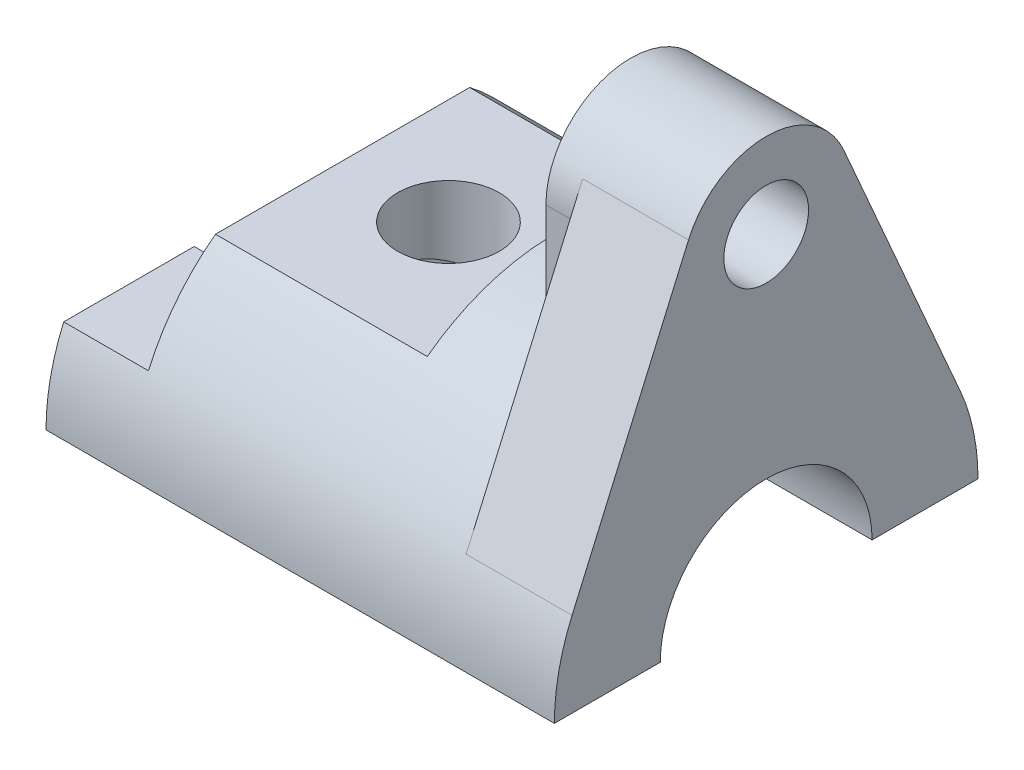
from build123d import *

# Parameters (mm, degrees)
EXTRUDE_1_DEPTH     = 120
SKETCH_2_R          = 10
EXTRUDE_2_DEPTH     = 25
SKETCH_3_R          = 10
EXTRUDE_3_DEPTH     = 7
SKETCH_4_W          = 115.012020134
SKETCH_4_H          = 32.406656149
CUT_EXTRUDE_1_DEPTH = 20
SKETCH_5_W          = 117.956013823
SKETCH_5_H          = 25.556494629
CUT_EXTRUDE_2_DEPTH = 50
SKETCH_6_R          = 12
CUT_EXTRUDE_3_DEPTH = 142.155942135


with BuildPart() as part:
    # Sketch 1 → Extrude 1 (new body)
    with BuildSketch(Plane(origin=(0, 0, 0), x_dir=(0, 0, -1), z_dir=(1, 0, 0))):
        with BuildLine():
            Line((-50, 0), (-25, 0))
            ThreePointArc((-25, 0), (0, 25), (25, 0))
            Line((25, 0), (50, 0))
            ThreePointArc((50, 0), (0, 50), (-50, 0))
        make_face()
    extrude(amount=-EXTRUDE_1_DEPTH)

    # Sketch 2 → Extrude 2 (add)
    with BuildSketch(Plane(origin=(0, 0, 0), x_dir=(0, 0, -1), z_dir=(1, 0, 0))):
        with BuildLine():
            Line((-18.33030278, 83), (-45.82575695, 20))
            ThreePointArc((-45.82575695, 20), (0, 50), (45.82575695, 20))
            Line((45.82575695, 20), (18.33030278, 83))
            ThreePointArc((18.33030278, 83), (0, 95), (-18.33030278, 83))
        make_face()
        with Locations((0, 75)):
            Circle(SKETCH_2_R, mode=Mode.SUBTRACT)
    extrude(amount=-EXTRUDE_2_DEPTH)

    # Sketch 3 → Extrude 3 (add)
    with BuildSketch(Plane.ZY.offset(25)):
        with BuildLine():
            Line((20, 75), (20, 45.82575695))
            ThreePointArc((20, 45.82575695), (0, 50), (-20, 45.82575695))
            Line((-20, 45.82575695), (-20, 75))
            ThreePointArc((-20, 75), (0, 95), (20, 75))
        make_face()
        with Locations(Location((0, 75, 0), (0, 0, 180))):
            Circle(SKETCH_3_R, mode=Mode.SUBTRACT)
    extrude(amount=EXTRUDE_3_DEPTH)

    # Sketch 4 → Cut-Extrude 1 (cut)
    with BuildSketch(Plane.ZY.offset(120)):
        with Locations((-1.177597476, 36.203328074)):
            Rectangle(SKETCH_4_W, SKETCH_4_H)
    extrude(amount=-CUT_EXTRUDE_1_DEPTH, mode=Mode.SUBTRACT)

    # Sketch 5 → Cut-Extrude 2 (cut)
    with BuildSketch(Plane.ZY.offset(100)):
        with Locations((-1.275730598, 52.778247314)):
            Rectangle(SKETCH_5_W, SKETCH_5_H)
    extrude(amount=-CUT_EXTRUDE_2_DEPTH, mode=Mode.SUBTRACT)

    # Sketch 6 → Cut-Extrude 3 (cut, through all)
    with BuildSketch(Plane(origin=(0, 40, 0), x_dir=(1, 0, 0), z_dir=(0, 1, 0))):
        with Locations(Location((-75, 0, 0), (0, 0, 270))):
            Circle(SKETCH_6_R)
    extrude(amount=-CUT_EXTRUDE_3_DEPTH, mode=Mode.SUBTRACT)


solid = part.part
